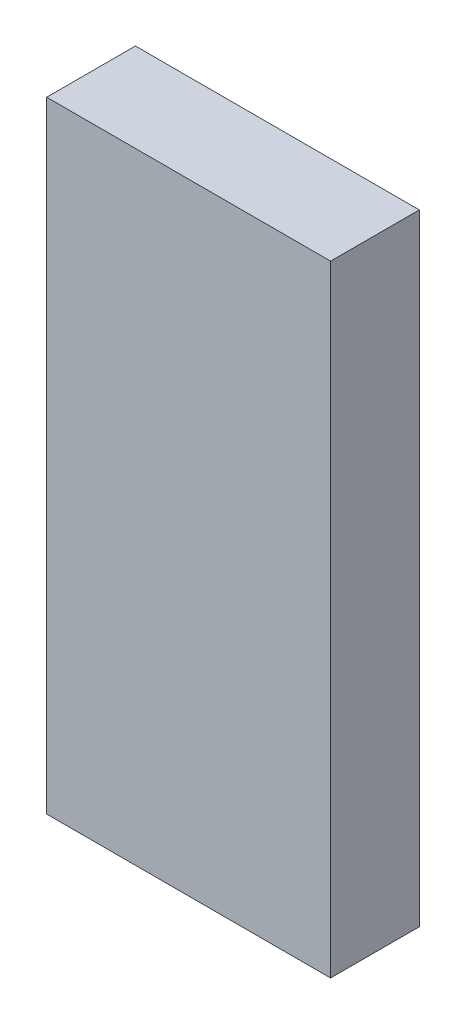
ISO-10303-21;
HEADER;
FILE_DESCRIPTION(('STEP AP214'),'2;1');
FILE_NAME('part.step','',(''),(''),'','','');
FILE_SCHEMA(('AUTOMOTIVE_DESIGN { 1 0 10303 214 1 1 1 1 }'));
ENDSEC;
DATA;
#1=APPLICATION_CONTEXT('core data for automotive mechanical design processes');
#2=APPLICATION_PROTOCOL_DEFINITION('international standard','automotive_design',2000,#1);
#3=PRODUCT_CONTEXT('',#1,'mechanical');
#4=PRODUCT('Part','Part','',(#3));
#5=PRODUCT_RELATED_PRODUCT_CATEGORY('part','',(#4));
#6=PRODUCT_DEFINITION_FORMATION('','',#4);
#7=PRODUCT_DEFINITION_CONTEXT('part definition',#1,'design');
#8=PRODUCT_DEFINITION('design','',#6,#7);
#9=PRODUCT_DEFINITION_SHAPE('','',#8);
#10=(LENGTH_UNIT() NAMED_UNIT(*) SI_UNIT(.MILLI.,.METRE.));
#11=(NAMED_UNIT(*) PLANE_ANGLE_UNIT() SI_UNIT($,.RADIAN.));
#12=(NAMED_UNIT(*) SI_UNIT($,.STERADIAN.) SOLID_ANGLE_UNIT());
#13=UNCERTAINTY_MEASURE_WITH_UNIT(LENGTH_MEASURE(1.E-05),#10,'distance_accuracy_value','');
#14=(GEOMETRIC_REPRESENTATION_CONTEXT(3) GLOBAL_UNCERTAINTY_ASSIGNED_CONTEXT((#13)) GLOBAL_UNIT_ASSIGNED_CONTEXT((#10,
#11,#12)) REPRESENTATION_CONTEXT('',''));
#15=CARTESIAN_POINT('',(0.,0.,0.));
#16=DIRECTION('',(0.,0.,1.));
#17=DIRECTION('',(1.,0.,0.));
#18=AXIS2_PLACEMENT_3D('',#15,#16,#17);
#19=CARTESIAN_POINT('',(0.,1.269999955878E-06,0.2499995));
#20=DIRECTION('',(0.,0.,-1.));
#21=DIRECTION('',(0.,-1.,0.));
#22=AXIS2_PLACEMENT_3D('',#19,#20,#21);
#23=PLANE('',#22);
#24=DIRECTION('',(0.,1.,0.));
#25=VECTOR('',#24,1.);
#26=CARTESIAN_POINT('',(-0.3999992,-0.87470996,0.2499995));
#27=LINE('',#26,#25);
#28=CARTESIAN_POINT('',(-0.3999992,-0.87470996,0.2499995));
#29=VERTEX_POINT('',#28);
#30=CARTESIAN_POINT('',(-0.3999992,0.8747125,0.2499995));
#31=VERTEX_POINT('',#30);
#32=EDGE_CURVE('E25',#29,#31,#27,.T.);
#33=ORIENTED_EDGE('',*,*,#32,.F.);
#34=DIRECTION('',(-1.,0.,0.));
#35=VECTOR('',#34,1.);
#36=CARTESIAN_POINT('',(0.3999992,-0.87470996,0.2499995));
#37=LINE('',#36,#35);
#38=CARTESIAN_POINT('',(0.3999992,-0.87470996,0.2499995));
#39=VERTEX_POINT('',#38);
#40=EDGE_CURVE('E97',#39,#29,#37,.T.);
#41=ORIENTED_EDGE('',*,*,#40,.F.);
#42=DIRECTION('',(0.,-1.,0.));
#43=VECTOR('',#42,1.);
#44=CARTESIAN_POINT('',(0.3999992,0.8747125,0.2499995));
#45=LINE('',#44,#43);
#46=CARTESIAN_POINT('',(0.3999992,0.8747125,0.2499995));
#47=VERTEX_POINT('',#46);
#48=EDGE_CURVE('E83',#47,#39,#45,.T.);
#49=ORIENTED_EDGE('',*,*,#48,.F.);
#50=DIRECTION('',(1.,0.,0.));
#51=VECTOR('',#50,1.);
#52=CARTESIAN_POINT('',(-0.3999992,0.8747125,0.2499995));
#53=LINE('',#52,#51);
#54=EDGE_CURVE('E87',#31,#47,#53,.T.);
#55=ORIENTED_EDGE('',*,*,#54,.F.);
#56=EDGE_LOOP('',(#33,#41,#49,#55));
#57=FACE_BOUND('',#56,.T.);
#58=ADVANCED_FACE('F17',(#57),#23,.F.);
#59=CARTESIAN_POINT('',(0.,1.269999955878E-06,0.));
#60=DIRECTION('',(0.,0.,-1.));
#61=DIRECTION('',(0.,-1.,0.));
#62=AXIS2_PLACEMENT_3D('',#59,#60,#61);
#63=PLANE('',#62);
#64=DIRECTION('',(1.,0.,0.));
#65=VECTOR('',#64,1.);
#66=CARTESIAN_POINT('',(-0.3999992,0.8747125,0.));
#67=LINE('',#66,#65);
#68=CARTESIAN_POINT('',(-0.3999992,0.8747125,0.));
#69=VERTEX_POINT('',#68);
#70=CARTESIAN_POINT('',(0.3999992,0.8747125,0.));
#71=VERTEX_POINT('',#70);
#72=EDGE_CURVE('E71',#69,#71,#67,.T.);
#73=ORIENTED_EDGE('',*,*,#72,.T.);
#74=DIRECTION('',(0.,-1.,0.));
#75=VECTOR('',#74,1.);
#76=CARTESIAN_POINT('',(0.3999992,0.8747125,0.));
#77=LINE('',#76,#75);
#78=CARTESIAN_POINT('',(0.3999992,-0.87470996,0.));
#79=VERTEX_POINT('',#78);
#80=EDGE_CURVE('E96',#71,#79,#77,.T.);
#81=ORIENTED_EDGE('',*,*,#80,.T.);
#82=DIRECTION('',(-1.,0.,0.));
#83=VECTOR('',#82,1.);
#84=CARTESIAN_POINT('',(0.3999992,-0.87470996,0.));
#85=LINE('',#84,#83);
#86=CARTESIAN_POINT('',(-0.3999992,-0.87470996,0.));
#87=VERTEX_POINT('',#86);
#88=EDGE_CURVE('E73',#79,#87,#85,.T.);
#89=ORIENTED_EDGE('',*,*,#88,.T.);
#90=DIRECTION('',(0.,1.,0.));
#91=VECTOR('',#90,1.);
#92=CARTESIAN_POINT('',(-0.3999992,-0.87470996,0.));
#93=LINE('',#92,#91);
#94=EDGE_CURVE('E11',#87,#69,#93,.T.);
#95=ORIENTED_EDGE('',*,*,#94,.T.);
#96=EDGE_LOOP('',(#73,#81,#89,#95));
#97=FACE_BOUND('',#96,.T.);
#98=ADVANCED_FACE('F69',(#97),#63,.T.);
#99=CARTESIAN_POINT('',(-0.3999992,-0.87470996,0.));
#100=DIRECTION('',(-1.,0.,0.));
#101=DIRECTION('',(0.,0.,1.));
#102=AXIS2_PLACEMENT_3D('',#99,#100,#101);
#103=PLANE('',#102);
#104=DIRECTION('',(0.,0.,1.));
#105=VECTOR('',#104,1.);
#106=CARTESIAN_POINT('',(-0.3999992,-0.87470996,0.));
#107=LINE('',#106,#105);
#108=EDGE_CURVE('E101',#87,#29,#107,.T.);
#109=ORIENTED_EDGE('',*,*,#108,.T.);
#110=ORIENTED_EDGE('',*,*,#32,.T.);
#111=DIRECTION('',(0.,0.,1.));
#112=VECTOR('',#111,1.);
#113=CARTESIAN_POINT('',(-0.3999992,0.8747125,0.));
#114=LINE('',#113,#112);
#115=EDGE_CURVE('E79',#69,#31,#114,.T.);
#116=ORIENTED_EDGE('',*,*,#115,.F.);
#117=ORIENTED_EDGE('',*,*,#94,.F.);
#118=EDGE_LOOP('',(#109,#110,#116,#117));
#119=FACE_BOUND('',#118,.T.);
#120=ADVANCED_FACE('F85',(#119),#103,.T.);
#121=CARTESIAN_POINT('',(0.3999992,-0.87470996,0.));
#122=DIRECTION('',(0.,-1.,0.));
#123=DIRECTION('',(0.,0.,-1.));
#124=AXIS2_PLACEMENT_3D('',#121,#122,#123);
#125=PLANE('',#124);
#126=DIRECTION('',(0.,0.,1.));
#127=VECTOR('',#126,1.);
#128=CARTESIAN_POINT('',(0.3999992,-0.87470996,0.));
#129=LINE('',#128,#127);
#130=EDGE_CURVE('E104',#79,#39,#129,.T.);
#131=ORIENTED_EDGE('',*,*,#130,.T.);
#132=ORIENTED_EDGE('',*,*,#40,.T.);
#133=ORIENTED_EDGE('',*,*,#108,.F.);
#134=ORIENTED_EDGE('',*,*,#88,.F.);
#135=EDGE_LOOP('',(#131,#132,#133,#134));
#136=FACE_BOUND('',#135,.T.);
#137=ADVANCED_FACE('F157',(#136),#125,.T.);
#138=CARTESIAN_POINT('',(0.3999992,0.8747125,0.));
#139=DIRECTION('',(1.,0.,0.));
#140=DIRECTION('',(0.,1.,0.));
#141=AXIS2_PLACEMENT_3D('',#138,#139,#140);
#142=PLANE('',#141);
#143=DIRECTION('',(0.,0.,1.));
#144=VECTOR('',#143,1.);
#145=CARTESIAN_POINT('',(0.3999992,0.8747125,0.));
#146=LINE('',#145,#144);
#147=EDGE_CURVE('E81',#71,#47,#146,.T.);
#148=ORIENTED_EDGE('',*,*,#147,.T.);
#149=ORIENTED_EDGE('',*,*,#48,.T.);
#150=ORIENTED_EDGE('',*,*,#130,.F.);
#151=ORIENTED_EDGE('',*,*,#80,.F.);
#152=EDGE_LOOP('',(#148,#149,#150,#151));
#153=FACE_BOUND('',#152,.T.);
#154=ADVANCED_FACE('F155',(#153),#142,.T.);
#155=CARTESIAN_POINT('',(-0.3999992,0.8747125,0.));
#156=DIRECTION('',(0.,1.,0.));
#157=DIRECTION('',(1.,0.,0.));
#158=AXIS2_PLACEMENT_3D('',#155,#156,#157);
#159=PLANE('',#158);
#160=ORIENTED_EDGE('',*,*,#115,.T.);
#161=ORIENTED_EDGE('',*,*,#54,.T.);
#162=ORIENTED_EDGE('',*,*,#147,.F.);
#163=ORIENTED_EDGE('',*,*,#72,.F.);
#164=EDGE_LOOP('',(#160,#161,#162,#163));
#165=FACE_BOUND('',#164,.T.);
#166=ADVANCED_FACE('F77',(#165),#159,.T.);
#167=CLOSED_SHELL('',(#58,#98,#120,#137,#154,#166));
#168=MANIFOLD_SOLID_BREP('B1',#167);
#169=ADVANCED_BREP_SHAPE_REPRESENTATION('',(#18,#168),#14);
#170=SHAPE_DEFINITION_REPRESENTATION(#9,#169);
ENDSEC;
END-ISO-10303-21;
